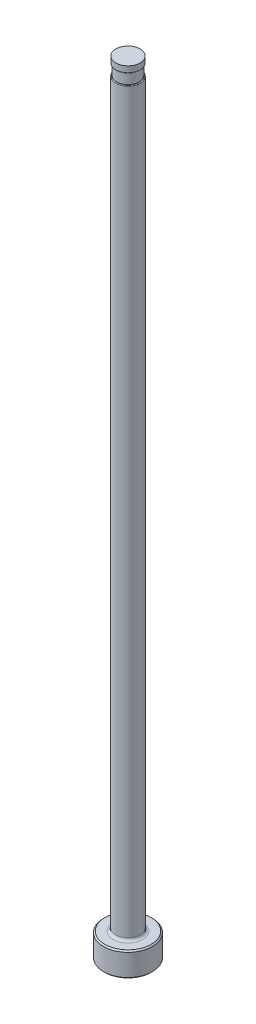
from build123d import *

# Parameters (mm, degrees)
CHAMFER1_SIZE     = 0.254
FILLET1_R         = 0.508
SKETCH2_W         = 0.2032
SKETCH2_H         = 2.032
D_SLOT_DEPTH      = 153.548755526
D_SLOT_DEPTH_BACK = 153.548755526
SKETCH5_W         = 0.0127
SKETCH5_H         = 1.27
FILLET2_R         = 0.127


with BuildPart() as part:
    # Sketch1 → Revolve1 (revolve)
    with BuildSketch(Plane.XY, mode=Mode.PRIVATE) as revolve1_sk:
        Polygon((0, 0), (-4.7625, 0), (-4.7625, 4.7498), (-2.38125, 4.7498), (-2.38125, 152.4), (0, 152.4), align=None)
    revolve(revolve1_sk.sketch.rotate(Axis((0, 259.958771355, 0), (0, -1, 0)), 270), axis=Axis((0, 259.958771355, 0), (0, -1, 0)))

    # Chamfer1
    chamfer1_edges = [part.edges().sort_by_distance(p)[0] for p in [
        (0, 4.7498, -4.7625),
        (0, 0, -4.7625),
    ]]
    chamfer(chamfer1_edges, length=CHAMFER1_SIZE)

    # Fillet1
    fillet1_edges = [part.edges().sort_by_distance(p)[0] for p in [
        (0, 4.7498, -2.38125),
    ]]
    fillet(fillet1_edges, radius=FILLET1_R)

    # Sketch2 → Vent Relief (revolve, cut)
    with BuildSketch(Plane.XY, mode=Mode.PRIVATE) as vent_relief_sk:
        with Locations((-2.27965, 150.114)):
            Rectangle(SKETCH2_W, SKETCH2_H)
    revolve(vent_relief_sk.sketch.rotate(Axis((0, 153.448281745, 0), (0, -1, 0)), 270), axis=Axis((0, 153.448281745, 0), (0, -1, 0)), mode=Mode.SUBTRACT)

    # Sketch3 → D-Slot (cut, two sides: drawn at the far end of the back side and taken through both)
    with BuildSketch(Plane.XY.offset(-D_SLOT_DEPTH_BACK)):
        with BuildLine():
            Line((-2.17805, 150.114), (-2.17805, 86.614))
            ThreePointArc((-2.17805, 86.614), (-2.229263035, 86.046038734), (-2.38125, 85.4964))
            Line((-2.38125, 85.4964), (-2.38125, 150.114))
            Line((-2.38125, 150.114), (-2.17805, 150.114))
        make_face()
    extrude(amount=D_SLOT_DEPTH + D_SLOT_DEPTH_BACK, mode=Mode.SUBTRACT)

    # Sketch5 → Vent Diameter (revolve, cut)
    with BuildSketch(Plane.XY, mode=Mode.PRIVATE) as vent_diameter_sk:
        with Locations((-2.3749, 151.765)):
            Rectangle(SKETCH5_W, SKETCH5_H)
    revolve(vent_diameter_sk.sketch.rotate(Axis((0, 152.687735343, 0), (0, -1, 0)), 90), axis=Axis((0, 152.687735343, 0), (0, -1, 0)), mode=Mode.SUBTRACT)

    # Fillet2
    fillet2_edges = [part.edges().sort_by_distance(p)[0] for p in [
        (1.995289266, 149.098, -1.299681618),
        (0, 151.13, 2.36855),
    ]]
    fillet(fillet2_edges, radius=FILLET2_R)


solid = part.part
